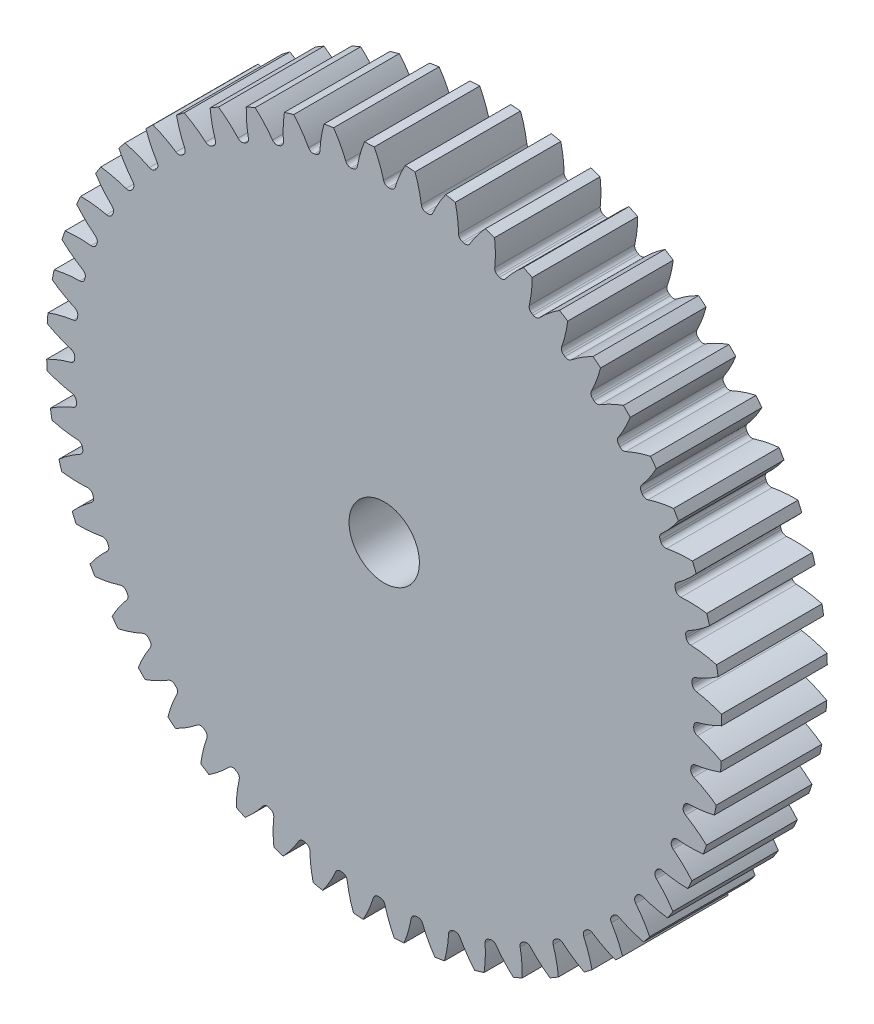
from build123d import *

# Parameters (mm, degrees)
SKETCH3_R         = 304.8
GEARBODY_DEPTH    = 95.25
TOOTHCUT_DEPTH    = 442.45061162
CIRPATTERN1_COUNT = 52
BOREDIA_R         = 31.75
BORE_DEPTH        = 12700


with BuildPart() as part:
    # Sketch3 → gearBody (new body)
    with BuildSketch(Plane.XY):
        Circle(SKETCH3_R)
    extrude(amount=GEARBODY_DEPTH)

    # Sketch2 → toothCut (cut, through all)
    with BuildSketch(Plane.XY):
        with BuildLine():
            ThreePointArc((279.349097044, -5.333102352), (279.362760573, -4.561579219), (279.374293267, -3.790021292))
            ThreePointArc((279.374293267, -3.790021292), (280.344314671, -1.028200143), (282.785370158, 0.587301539))
            ThreePointArc((282.785370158, 0.587301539), (294.024847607, 4.24801386), (304.8, 9.10833884))
            ThreePointArc((304.8, 9.10833884), (304.895418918, -4.978489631), (304.34013949, -19.054693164))
            ThreePointArc((304.34013949, -19.054693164), (293.729412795, -13.845168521), (282.615443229, -9.819457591))
            ThreePointArc((282.615443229, -9.819457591), (280.228432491, -8.125120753), (279.349097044, -5.333102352))
        make_face()
    toothcut = extrude(amount=TOOTHCUT_DEPTH, mode=Mode.SUBTRACT)

    # CirPattern1: toothCut ×52 about axis
    cirpattern1_axis = Axis((0, 0, 0), (0, 0, 1))
    for i in range(1, CIRPATTERN1_COUNT):
        add(toothcut.rotate(cirpattern1_axis, i * 360 / CIRPATTERN1_COUNT), mode=Mode.SUBTRACT)

    # boreDia → bore (cut, symmetric)
    with BuildSketch(Plane.XY):
        Circle(BOREDIA_R)
    extrude(amount=BORE_DEPTH, both=True, mode=Mode.SUBTRACT)


solid = part.part
